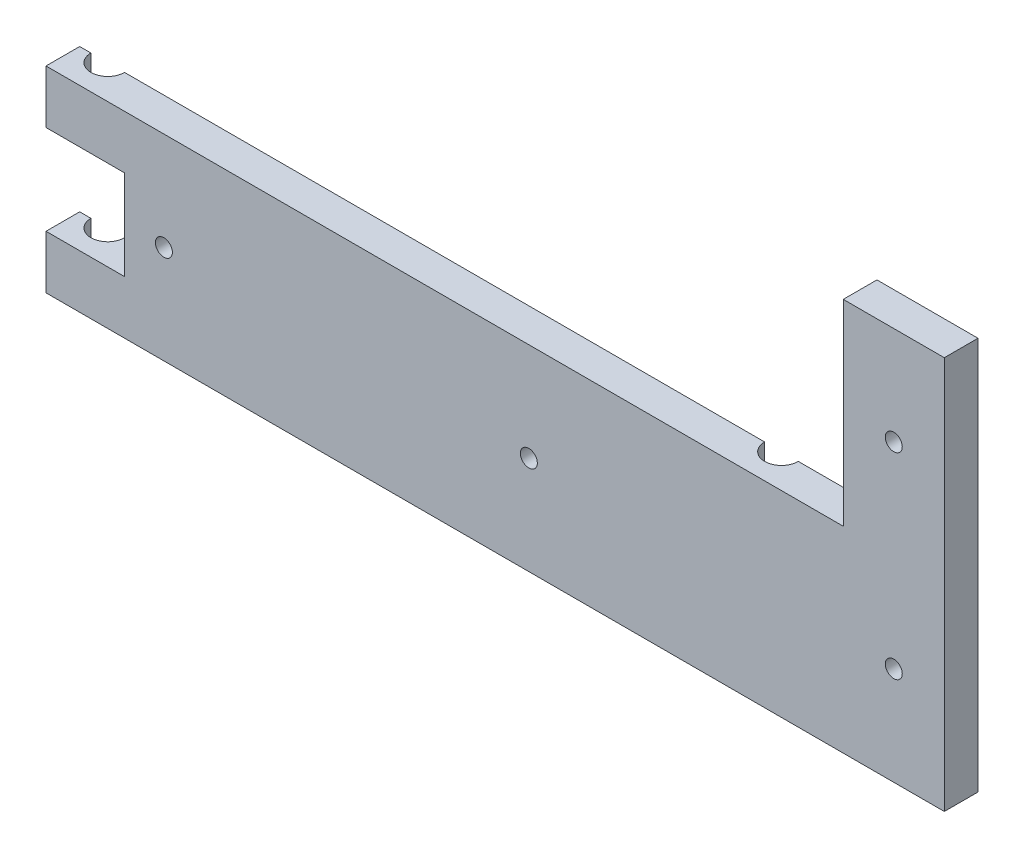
from build123d import *

# Parameters (mm, degrees)
ESQUISSE1_R             = 1.51
EXTRUSION1_DEPTH        = 6
ESQUISSE2_R             = 3
ENL_V_MAT_EXTRU_1_DEPTH = 171.179317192


with BuildPart() as part:
    # Esquisse1 → Extrusion1 (new body)
    with BuildSketch(Plane.XY):
        Polygon((155, 70), (137, 70), (137, 35), (-5, 35), (-5, 25.5), (9, 25.5), (9, 9.5), (-5, 9.5), (-5, 0), (155, 0), align=None)
        with Locations((146, 17.5)):
            Circle(ESQUISSE1_R, mode=Mode.SUBTRACT)
        with Locations((146, 52.5)):
            Circle(ESQUISSE1_R, mode=Mode.SUBTRACT)
        with Locations((81, 17.5)):
            Circle(ESQUISSE1_R, mode=Mode.SUBTRACT)
        with Locations((16, 17.5)):
            Circle(ESQUISSE1_R, mode=Mode.SUBTRACT)
    extrude(amount=EXTRUSION1_DEPTH)

    # Esquisse2 → Enl_v. mat.-Extru.1 (cut, through all)
    with BuildSketch(Plane.XZ):
        Circle(ESQUISSE2_R)
        with Locations((120, 0)):
            Circle(ESQUISSE2_R)
    extrude(amount=-ENL_V_MAT_EXTRU_1_DEPTH, mode=Mode.SUBTRACT)


solid = part.part
